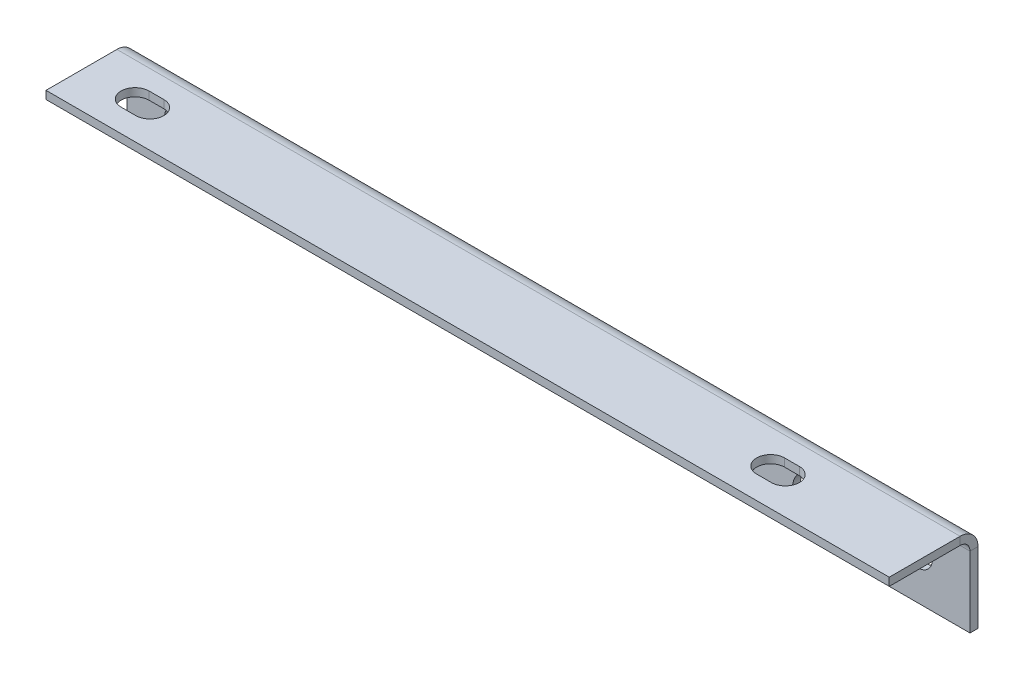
ISO-10303-21;
HEADER;
FILE_DESCRIPTION(('STEP AP214'),'2;1');
FILE_NAME('part.step','',(''),(''),'','','');
FILE_SCHEMA(('AUTOMOTIVE_DESIGN { 1 0 10303 214 1 1 1 1 }'));
ENDSEC;
DATA;
#1=APPLICATION_CONTEXT('core data for automotive mechanical design processes');
#2=APPLICATION_PROTOCOL_DEFINITION('international standard','automotive_design',2000,#1);
#3=PRODUCT_CONTEXT('',#1,'mechanical');
#4=PRODUCT('Part','Part','',(#3));
#5=PRODUCT_RELATED_PRODUCT_CATEGORY('part','',(#4));
#6=PRODUCT_DEFINITION_FORMATION('','',#4);
#7=PRODUCT_DEFINITION_CONTEXT('part definition',#1,'design');
#8=PRODUCT_DEFINITION('design','',#6,#7);
#9=PRODUCT_DEFINITION_SHAPE('','',#8);
#10=(LENGTH_UNIT() NAMED_UNIT(*) SI_UNIT(.MILLI.,.METRE.));
#11=(NAMED_UNIT(*) PLANE_ANGLE_UNIT() SI_UNIT($,.RADIAN.));
#12=(NAMED_UNIT(*) SI_UNIT($,.STERADIAN.) SOLID_ANGLE_UNIT());
#13=UNCERTAINTY_MEASURE_WITH_UNIT(LENGTH_MEASURE(1.E-05),#10,'distance_accuracy_value','');
#14=(GEOMETRIC_REPRESENTATION_CONTEXT(3) GLOBAL_UNCERTAINTY_ASSIGNED_CONTEXT((#13)) GLOBAL_UNIT_ASSIGNED_CONTEXT((#10,
#11,#12)) REPRESENTATION_CONTEXT('',''));
#15=CARTESIAN_POINT('',(0.,0.,0.));
#16=DIRECTION('',(0.,0.,1.));
#17=DIRECTION('',(1.,0.,0.));
#18=AXIS2_PLACEMENT_3D('',#15,#16,#17);
#19=CARTESIAN_POINT('',(180.975,-3.429,0.));
#20=DIRECTION('',(1.,0.,0.));
#21=DIRECTION('',(0.,0.,-1.));
#22=AXIS2_PLACEMENT_3D('',#19,#20,#21);
#23=PLANE('',#22);
#24=DIRECTION('',(0.,0.,-1.));
#25=VECTOR('',#24,1.);
#26=CARTESIAN_POINT('',(180.975,-3.429,0.));
#27=LINE('',#26,#25);
#28=CARTESIAN_POINT('',(180.975,-3.429,38.0999999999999));
#29=VERTEX_POINT('',#28);
#30=CARTESIAN_POINT('',(180.975,-3.42900000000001,7.67079999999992));
#31=VERTEX_POINT('',#30);
#32=EDGE_CURVE('E215',#29,#31,#27,.T.);
#33=ORIENTED_EDGE('',*,*,#32,.T.);
#34=DIRECTION('',(0.,1.,0.));
#35=VECTOR('',#34,1.);
#36=CARTESIAN_POINT('',(180.975,-3.42900000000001,7.67079999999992));
#37=LINE('',#36,#35);
#38=CARTESIAN_POINT('',(180.975,0.,7.67079999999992));
#39=VERTEX_POINT('',#38);
#40=EDGE_CURVE('E186',#31,#39,#37,.T.);
#41=ORIENTED_EDGE('',*,*,#40,.T.);
#42=DIRECTION('',(0.,0.,-1.));
#43=VECTOR('',#42,1.);
#44=CARTESIAN_POINT('',(180.975,0.,0.));
#45=LINE('',#44,#43);
#46=CARTESIAN_POINT('',(180.975,0.,38.0999999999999));
#47=VERTEX_POINT('',#46);
#48=EDGE_CURVE('E205',#47,#39,#45,.T.);
#49=ORIENTED_EDGE('',*,*,#48,.F.);
#50=DIRECTION('',(0.,1.,0.));
#51=VECTOR('',#50,1.);
#52=CARTESIAN_POINT('',(180.975,-3.429,38.0999999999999));
#53=LINE('',#52,#51);
#54=EDGE_CURVE('E220',#29,#47,#53,.T.);
#55=ORIENTED_EDGE('',*,*,#54,.F.);
#56=EDGE_LOOP('',(#33,#41,#49,#55));
#57=FACE_BOUND('',#56,.T.);
#58=ADVANCED_FACE('F59',(#57),#23,.T.);
#59=CARTESIAN_POINT('',(0.,-3.429,0.));
#60=DIRECTION('',(0.,1.,0.));
#61=DIRECTION('',(0.,0.,1.));
#62=AXIS2_PLACEMENT_3D('',#59,#60,#61);
#63=PLANE('',#62);
#64=DIRECTION('',(-1.,0.,0.));
#65=VECTOR('',#64,1.);
#66=CARTESIAN_POINT('',(0.,-3.429,16.225));
#67=LINE('',#66,#65);
#68=CARTESIAN_POINT('',(-152.273,-3.429,16.225));
#69=VERTEX_POINT('',#68);
#70=CARTESIAN_POINT('',(-158.623,-3.429,16.225));
#71=VERTEX_POINT('',#70);
#72=EDGE_CURVE('E121',#69,#71,#67,.T.);
#73=ORIENTED_EDGE('',*,*,#72,.T.);
#74=CARTESIAN_POINT('',(-158.623,-3.429,22.225));
#75=DIRECTION('',(0.,1.,0.));
#76=DIRECTION('',(0.,0.,1.));
#77=AXIS2_PLACEMENT_3D('',#74,#75,#76);
#78=CIRCLE('',#77,6.00000000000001);
#79=CARTESIAN_POINT('',(-158.623,-3.429,28.225));
#80=VERTEX_POINT('',#79);
#81=EDGE_CURVE('E294',#71,#80,#78,.T.);
#82=ORIENTED_EDGE('',*,*,#81,.T.);
#83=DIRECTION('',(1.,0.,0.));
#84=VECTOR('',#83,1.);
#85=CARTESIAN_POINT('',(0.,-3.429,28.225));
#86=LINE('',#85,#84);
#87=CARTESIAN_POINT('',(-152.273,-3.429,28.225));
#88=VERTEX_POINT('',#87);
#89=EDGE_CURVE('E78',#80,#88,#86,.T.);
#90=ORIENTED_EDGE('',*,*,#89,.T.);
#91=CARTESIAN_POINT('',(-152.273,-3.429,22.225));
#92=DIRECTION('',(0.,1.,0.));
#93=DIRECTION('',(0.,0.,1.));
#94=AXIS2_PLACEMENT_3D('',#91,#92,#93);
#95=CIRCLE('',#94,6.00000000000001);
#96=EDGE_CURVE('E292',#88,#69,#95,.T.);
#97=ORIENTED_EDGE('',*,*,#96,.T.);
#98=EDGE_LOOP('',(#73,#82,#90,#97));
#99=FACE_BOUND('',#98,.T.);
#100=DIRECTION('',(-1.,0.,0.));
#101=VECTOR('',#100,1.);
#102=CARTESIAN_POINT('',(0.,-3.429,16.225));
#103=LINE('',#102,#101);
#104=CARTESIAN_POINT('',(120.523,-3.429,16.225));
#105=VERTEX_POINT('',#104);
#106=CARTESIAN_POINT('',(114.173,-3.429,16.225));
#107=VERTEX_POINT('',#106);
#108=EDGE_CURVE('E240',#105,#107,#103,.T.);
#109=ORIENTED_EDGE('',*,*,#108,.T.);
#110=CARTESIAN_POINT('',(114.173,-3.429,22.225));
#111=DIRECTION('',(0.,1.,0.));
#112=DIRECTION('',(0.,0.,1.));
#113=AXIS2_PLACEMENT_3D('',#110,#111,#112);
#114=CIRCLE('',#113,6.);
#115=CARTESIAN_POINT('',(114.173,-3.429,28.225));
#116=VERTEX_POINT('',#115);
#117=EDGE_CURVE('E289',#107,#116,#114,.T.);
#118=ORIENTED_EDGE('',*,*,#117,.T.);
#119=DIRECTION('',(1.,0.,0.));
#120=VECTOR('',#119,1.);
#121=CARTESIAN_POINT('',(0.,-3.429,28.225));
#122=LINE('',#121,#120);
#123=CARTESIAN_POINT('',(120.523,-3.429,28.225));
#124=VERTEX_POINT('',#123);
#125=EDGE_CURVE('E237',#116,#124,#122,.T.);
#126=ORIENTED_EDGE('',*,*,#125,.T.);
#127=CARTESIAN_POINT('',(120.523,-3.429,22.225));
#128=DIRECTION('',(0.,1.,0.));
#129=DIRECTION('',(0.,0.,1.));
#130=AXIS2_PLACEMENT_3D('',#127,#128,#129);
#131=CIRCLE('',#130,6.);
#132=EDGE_CURVE('E286',#124,#105,#131,.T.);
#133=ORIENTED_EDGE('',*,*,#132,.T.);
#134=EDGE_LOOP('',(#109,#118,#126,#133));
#135=FACE_BOUND('',#134,.T.);
#136=DIRECTION('',(1.,0.,0.));
#137=VECTOR('',#136,1.);
#138=CARTESIAN_POINT('',(180.975,-3.42900000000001,7.67079999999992));
#139=LINE('',#138,#137);
#140=CARTESIAN_POINT('',(-180.975,-3.42900000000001,7.67079999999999));
#141=VERTEX_POINT('',#140);
#142=EDGE_CURVE('E334',#31,#141,#139,.F.);
#143=ORIENTED_EDGE('',*,*,#142,.F.);
#144=ORIENTED_EDGE('',*,*,#32,.F.);
#145=DIRECTION('',(1.,0.,0.));
#146=VECTOR('',#145,1.);
#147=CARTESIAN_POINT('',(-180.975,-3.429,38.1));
#148=LINE('',#147,#146);
#149=CARTESIAN_POINT('',(-180.975,-3.429,38.1));
#150=VERTEX_POINT('',#149);
#151=EDGE_CURVE('E340',#150,#29,#148,.T.);
#152=ORIENTED_EDGE('',*,*,#151,.F.);
#153=DIRECTION('',(0.,0.,1.));
#154=VECTOR('',#153,1.);
#155=CARTESIAN_POINT('',(-180.975,-3.429,0.));
#156=LINE('',#155,#154);
#157=EDGE_CURVE('E219',#141,#150,#156,.T.);
#158=ORIENTED_EDGE('',*,*,#157,.F.);
#159=EDGE_LOOP('',(#143,#144,#152,#158));
#160=FACE_BOUND('',#159,.T.);
#161=ADVANCED_FACE('F349',(#99,#135,#160),#63,.F.);
#162=CARTESIAN_POINT('',(0.,0.,0.));
#163=DIRECTION('',(0.,1.,0.));
#164=DIRECTION('',(0.,0.,1.));
#165=AXIS2_PLACEMENT_3D('',#162,#163,#164);
#166=PLANE('',#165);
#167=CARTESIAN_POINT('',(-158.623,0.,22.225));
#168=DIRECTION('',(0.,1.,0.));
#169=DIRECTION('',(0.,0.,1.));
#170=AXIS2_PLACEMENT_3D('',#167,#168,#169);
#171=CIRCLE('',#170,6.00000000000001);
#172=CARTESIAN_POINT('',(-158.623,0.,16.225));
#173=VERTEX_POINT('',#172);
#174=CARTESIAN_POINT('',(-158.623,0.,28.225));
#175=VERTEX_POINT('',#174);
#176=EDGE_CURVE('E13',#173,#175,#171,.T.);
#177=ORIENTED_EDGE('',*,*,#176,.F.);
#178=DIRECTION('',(-1.,0.,0.));
#179=VECTOR('',#178,1.);
#180=CARTESIAN_POINT('',(0.,0.,16.225));
#181=LINE('',#180,#179);
#182=CARTESIAN_POINT('',(-152.273,0.,16.225));
#183=VERTEX_POINT('',#182);
#184=EDGE_CURVE('E114',#183,#173,#181,.T.);
#185=ORIENTED_EDGE('',*,*,#184,.F.);
#186=CARTESIAN_POINT('',(-152.273,0.,22.225));
#187=DIRECTION('',(0.,1.,0.));
#188=DIRECTION('',(0.,0.,1.));
#189=AXIS2_PLACEMENT_3D('',#186,#187,#188);
#190=CIRCLE('',#189,6.00000000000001);
#191=CARTESIAN_POINT('',(-152.273,0.,28.225));
#192=VERTEX_POINT('',#191);
#193=EDGE_CURVE('E69',#192,#183,#190,.T.);
#194=ORIENTED_EDGE('',*,*,#193,.F.);
#195=DIRECTION('',(1.,0.,0.));
#196=VECTOR('',#195,1.);
#197=CARTESIAN_POINT('',(0.,0.,28.225));
#198=LINE('',#197,#196);
#199=EDGE_CURVE('E241',#175,#192,#198,.T.);
#200=ORIENTED_EDGE('',*,*,#199,.F.);
#201=EDGE_LOOP('',(#177,#185,#194,#200));
#202=FACE_BOUND('',#201,.T.);
#203=CARTESIAN_POINT('',(114.173,0.,22.225));
#204=DIRECTION('',(0.,1.,0.));
#205=DIRECTION('',(0.,0.,1.));
#206=AXIS2_PLACEMENT_3D('',#203,#204,#205);
#207=CIRCLE('',#206,6.);
#208=CARTESIAN_POINT('',(114.173,0.,16.225));
#209=VERTEX_POINT('',#208);
#210=CARTESIAN_POINT('',(114.173,0.,28.225));
#211=VERTEX_POINT('',#210);
#212=EDGE_CURVE('E246',#209,#211,#207,.T.);
#213=ORIENTED_EDGE('',*,*,#212,.F.);
#214=DIRECTION('',(-1.,0.,0.));
#215=VECTOR('',#214,1.);
#216=CARTESIAN_POINT('',(0.,0.,16.225));
#217=LINE('',#216,#215);
#218=CARTESIAN_POINT('',(120.523,0.,16.225));
#219=VERTEX_POINT('',#218);
#220=EDGE_CURVE('E238',#219,#209,#217,.T.);
#221=ORIENTED_EDGE('',*,*,#220,.F.);
#222=CARTESIAN_POINT('',(120.523,0.,22.225));
#223=DIRECTION('',(0.,1.,0.));
#224=DIRECTION('',(0.,0.,1.));
#225=AXIS2_PLACEMENT_3D('',#222,#223,#224);
#226=CIRCLE('',#225,6.);
#227=CARTESIAN_POINT('',(120.523,0.,28.225));
#228=VERTEX_POINT('',#227);
#229=EDGE_CURVE('E222',#228,#219,#226,.T.);
#230=ORIENTED_EDGE('',*,*,#229,.F.);
#231=DIRECTION('',(1.,0.,0.));
#232=VECTOR('',#231,1.);
#233=CARTESIAN_POINT('',(0.,0.,28.225));
#234=LINE('',#233,#232);
#235=EDGE_CURVE('E235',#211,#228,#234,.T.);
#236=ORIENTED_EDGE('',*,*,#235,.F.);
#237=EDGE_LOOP('',(#213,#221,#230,#236));
#238=FACE_BOUND('',#237,.T.);
#239=ORIENTED_EDGE('',*,*,#48,.T.);
#240=DIRECTION('',(1.,0.,0.));
#241=VECTOR('',#240,1.);
#242=CARTESIAN_POINT('',(180.975,0.,7.67079999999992));
#243=LINE('',#242,#241);
#244=CARTESIAN_POINT('',(-180.975,0.,7.67079999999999));
#245=VERTEX_POINT('',#244);
#246=EDGE_CURVE('E180',#39,#245,#243,.F.);
#247=ORIENTED_EDGE('',*,*,#246,.T.);
#248=DIRECTION('',(0.,0.,1.));
#249=VECTOR('',#248,1.);
#250=CARTESIAN_POINT('',(-180.975,0.,0.));
#251=LINE('',#250,#249);
#252=CARTESIAN_POINT('',(-180.975,0.,38.1));
#253=VERTEX_POINT('',#252);
#254=EDGE_CURVE('E197',#245,#253,#251,.T.);
#255=ORIENTED_EDGE('',*,*,#254,.T.);
#256=DIRECTION('',(1.,0.,0.));
#257=VECTOR('',#256,1.);
#258=CARTESIAN_POINT('',(-180.975,0.,38.1));
#259=LINE('',#258,#257);
#260=EDGE_CURVE('E211',#253,#47,#259,.T.);
#261=ORIENTED_EDGE('',*,*,#260,.T.);
#262=EDGE_LOOP('',(#239,#247,#255,#261));
#263=FACE_BOUND('',#262,.T.);
#264=ADVANCED_FACE('F201',(#202,#238,#263),#166,.T.);
#265=CARTESIAN_POINT('',(-180.975,-3.429,0.));
#266=DIRECTION('',(-1.,0.,0.));
#267=DIRECTION('',(0.,0.,1.));
#268=AXIS2_PLACEMENT_3D('',#265,#266,#267);
#269=PLANE('',#268);
#270=DIRECTION('',(0.,1.,0.));
#271=VECTOR('',#270,1.);
#272=CARTESIAN_POINT('',(-180.975,-3.42900000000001,7.67079999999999));
#273=LINE('',#272,#271);
#274=EDGE_CURVE('E190',#141,#245,#273,.T.);
#275=ORIENTED_EDGE('',*,*,#274,.F.);
#276=ORIENTED_EDGE('',*,*,#157,.T.);
#277=DIRECTION('',(0.,1.,0.));
#278=VECTOR('',#277,1.);
#279=CARTESIAN_POINT('',(-180.975,-3.429,38.1));
#280=LINE('',#279,#278);
#281=EDGE_CURVE('E209',#150,#253,#280,.T.);
#282=ORIENTED_EDGE('',*,*,#281,.T.);
#283=ORIENTED_EDGE('',*,*,#254,.F.);
#284=EDGE_LOOP('',(#275,#276,#282,#283));
#285=FACE_BOUND('',#284,.T.);
#286=ADVANCED_FACE('F61',(#285),#269,.T.);
#287=CARTESIAN_POINT('',(-180.975,-3.429,38.1));
#288=DIRECTION('',(0.,0.,1.));
#289=DIRECTION('',(1.,0.,0.));
#290=AXIS2_PLACEMENT_3D('',#287,#288,#289);
#291=PLANE('',#290);
#292=ORIENTED_EDGE('',*,*,#260,.F.);
#293=ORIENTED_EDGE('',*,*,#281,.F.);
#294=ORIENTED_EDGE('',*,*,#151,.T.);
#295=ORIENTED_EDGE('',*,*,#54,.T.);
#296=EDGE_LOOP('',(#292,#293,#294,#295));
#297=FACE_BOUND('',#296,.T.);
#298=ADVANCED_FACE('F393',(#297),#291,.T.);
#299=CARTESIAN_POINT('',(-180.975,-7.67080000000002,7.67079999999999));
#300=DIRECTION('',(-1.,0.,0.));
#301=DIRECTION('',(0.,0.,1.));
#302=AXIS2_PLACEMENT_3D('',#299,#300,#301);
#303=PLANE('',#302);
#304=DIRECTION('',(0.,0.,1.));
#305=VECTOR('',#304,1.);
#306=CARTESIAN_POINT('',(-180.975,-7.67079999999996,0.));
#307=LINE('',#306,#305);
#308=CARTESIAN_POINT('',(-180.975,-7.67080000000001,3.42899999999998));
#309=VERTEX_POINT('',#308);
#310=CARTESIAN_POINT('',(-180.975,-7.67079999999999,0.));
#311=VERTEX_POINT('',#310);
#312=EDGE_CURVE('E234',#309,#311,#307,.F.);
#313=ORIENTED_EDGE('',*,*,#312,.F.);
#314=CARTESIAN_POINT('',(-180.975,-7.67080000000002,7.67079999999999));
#315=DIRECTION('',(1.,0.,0.));
#316=DIRECTION('',(0.,0.,-1.));
#317=AXIS2_PLACEMENT_3D('',#314,#315,#316);
#318=CIRCLE('',#317,4.24180000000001);
#319=EDGE_CURVE('E193',#141,#309,#318,.F.);
#320=ORIENTED_EDGE('',*,*,#319,.F.);
#321=ORIENTED_EDGE('',*,*,#274,.T.);
#322=CARTESIAN_POINT('',(-180.975,-7.67080000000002,7.67079999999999));
#323=DIRECTION('',(1.,0.,0.));
#324=DIRECTION('',(0.,0.,-1.));
#325=AXIS2_PLACEMENT_3D('',#322,#323,#324);
#326=CIRCLE('',#325,7.67080000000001);
#327=EDGE_CURVE('E176',#245,#311,#326,.F.);
#328=ORIENTED_EDGE('',*,*,#327,.T.);
#329=EDGE_LOOP('',(#313,#320,#321,#328));
#330=FACE_BOUND('',#329,.T.);
#331=ADVANCED_FACE('F191',(#330),#303,.T.);
#332=CARTESIAN_POINT('',(180.975,-7.67080000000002,7.67079999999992));
#333=DIRECTION('',(-1.,0.,0.));
#334=DIRECTION('',(0.,0.,1.));
#335=AXIS2_PLACEMENT_3D('',#332,#333,#334);
#336=PLANE('',#335);
#337=CARTESIAN_POINT('',(180.975,-7.67080000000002,7.67079999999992));
#338=DIRECTION('',(1.,0.,0.));
#339=DIRECTION('',(0.,0.,-1.));
#340=AXIS2_PLACEMENT_3D('',#337,#338,#339);
#341=CIRCLE('',#340,4.24180000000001);
#342=CARTESIAN_POINT('',(180.975,-7.67080000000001,3.42899999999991));
#343=VERTEX_POINT('',#342);
#344=EDGE_CURVE('E307',#343,#31,#341,.T.);
#345=ORIENTED_EDGE('',*,*,#344,.F.);
#346=DIRECTION('',(0.,0.,1.));
#347=VECTOR('',#346,1.);
#348=CARTESIAN_POINT('',(180.975,-7.6708,3.42899999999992));
#349=LINE('',#348,#347);
#350=CARTESIAN_POINT('',(180.975,-7.67079999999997,0.));
#351=VERTEX_POINT('',#350);
#352=EDGE_CURVE('E326',#343,#351,#349,.F.);
#353=ORIENTED_EDGE('',*,*,#352,.T.);
#354=CARTESIAN_POINT('',(180.975,-7.67080000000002,7.67079999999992));
#355=DIRECTION('',(1.,0.,0.));
#356=DIRECTION('',(0.,0.,-1.));
#357=AXIS2_PLACEMENT_3D('',#354,#355,#356);
#358=CIRCLE('',#357,7.67080000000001);
#359=EDGE_CURVE('E206',#351,#39,#358,.T.);
#360=ORIENTED_EDGE('',*,*,#359,.T.);
#361=ORIENTED_EDGE('',*,*,#40,.F.);
#362=EDGE_LOOP('',(#345,#353,#360,#361));
#363=FACE_BOUND('',#362,.T.);
#364=ADVANCED_FACE('F356',(#363),#336,.F.);
#365=CARTESIAN_POINT('',(180.975,-7.67080000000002,7.67079999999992));
#366=DIRECTION('',(1.,0.,0.));
#367=DIRECTION('',(0.,0.,-1.));
#368=AXIS2_PLACEMENT_3D('',#365,#366,#367);
#369=CYLINDRICAL_SURFACE('',#368,7.67080000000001);
#370=ORIENTED_EDGE('',*,*,#246,.F.);
#371=ORIENTED_EDGE('',*,*,#359,.F.);
#372=DIRECTION('',(1.,0.,0.));
#373=VECTOR('',#372,1.);
#374=CARTESIAN_POINT('',(-180.975,-7.67079999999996,0.));
#375=LINE('',#374,#373);
#376=EDGE_CURVE('E183',#351,#311,#375,.F.);
#377=ORIENTED_EDGE('',*,*,#376,.T.);
#378=ORIENTED_EDGE('',*,*,#327,.F.);
#379=EDGE_LOOP('',(#370,#371,#377,#378));
#380=FACE_BOUND('',#379,.T.);
#381=ADVANCED_FACE('F178',(#380),#369,.T.);
#382=CARTESIAN_POINT('',(180.975,-7.67080000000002,7.67079999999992));
#383=DIRECTION('',(1.,0.,0.));
#384=DIRECTION('',(0.,0.,-1.));
#385=AXIS2_PLACEMENT_3D('',#382,#383,#384);
#386=CYLINDRICAL_SURFACE('',#385,4.24180000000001);
#387=ORIENTED_EDGE('',*,*,#142,.T.);
#388=ORIENTED_EDGE('',*,*,#319,.T.);
#389=DIRECTION('',(1.,0.,0.));
#390=VECTOR('',#389,1.);
#391=CARTESIAN_POINT('',(-180.975,-7.67079999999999,3.42899999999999));
#392=LINE('',#391,#390);
#393=EDGE_CURVE('E329',#309,#343,#392,.T.);
#394=ORIENTED_EDGE('',*,*,#393,.T.);
#395=ORIENTED_EDGE('',*,*,#344,.T.);
#396=EDGE_LOOP('',(#387,#388,#394,#395));
#397=FACE_BOUND('',#396,.T.);
#398=ADVANCED_FACE('F351',(#397),#386,.F.);
#399=CARTESIAN_POINT('',(180.975,-38.1,-1.87350135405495E-13));
#400=DIRECTION('',(-1.,0.,0.));
#401=DIRECTION('',(0.,0.,1.));
#402=AXIS2_PLACEMENT_3D('',#399,#400,#401);
#403=PLANE('',#402);
#404=ORIENTED_EDGE('',*,*,#352,.F.);
#405=DIRECTION('',(0.,1.,0.));
#406=VECTOR('',#405,1.);
#407=CARTESIAN_POINT('',(180.975,-38.1,3.42899999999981));
#408=LINE('',#407,#406);
#409=CARTESIAN_POINT('',(180.975,-38.1,3.42899999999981));
#410=VERTEX_POINT('',#409);
#411=EDGE_CURVE('E323',#343,#410,#408,.F.);
#412=ORIENTED_EDGE('',*,*,#411,.T.);
#413=DIRECTION('',(0.,0.,1.));
#414=VECTOR('',#413,1.);
#415=CARTESIAN_POINT('',(180.975,-38.1,-1.8748609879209E-13));
#416=LINE('',#415,#414);
#417=CARTESIAN_POINT('',(180.975,-38.1,-1.87520369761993E-13));
#418=VERTEX_POINT('',#417);
#419=EDGE_CURVE('E304',#418,#410,#416,.T.);
#420=ORIENTED_EDGE('',*,*,#419,.F.);
#421=DIRECTION('',(0.,-1.,0.));
#422=VECTOR('',#421,1.);
#423=CARTESIAN_POINT('',(180.975,0.,0.));
#424=LINE('',#423,#422);
#425=EDGE_CURVE('E316',#351,#418,#424,.T.);
#426=ORIENTED_EDGE('',*,*,#425,.F.);
#427=EDGE_LOOP('',(#404,#412,#420,#426));
#428=FACE_BOUND('',#427,.T.);
#429=ADVANCED_FACE('F360',(#428),#403,.F.);
#430=CARTESIAN_POINT('',(-180.975,-3.42899999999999,0.));
#431=DIRECTION('',(1.,0.,0.));
#432=DIRECTION('',(0.,0.,-1.));
#433=AXIS2_PLACEMENT_3D('',#430,#431,#432);
#434=PLANE('',#433);
#435=ORIENTED_EDGE('',*,*,#312,.T.);
#436=DIRECTION('',(0.,1.,0.));
#437=VECTOR('',#436,1.);
#438=CARTESIAN_POINT('',(-180.975,0.,0.));
#439=LINE('',#438,#437);
#440=CARTESIAN_POINT('',(-180.975,-38.1,-1.21031233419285E-13));
#441=VERTEX_POINT('',#440);
#442=EDGE_CURVE('E311',#441,#311,#439,.T.);
#443=ORIENTED_EDGE('',*,*,#442,.F.);
#444=DIRECTION('',(0.,0.,1.));
#445=VECTOR('',#444,1.);
#446=CARTESIAN_POINT('',(-180.975,-38.1,-1.2105314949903E-13));
#447=LINE('',#446,#445);
#448=CARTESIAN_POINT('',(-180.975,-38.1,3.42899999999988));
#449=VERTEX_POINT('',#448);
#450=EDGE_CURVE('E308',#441,#449,#447,.T.);
#451=ORIENTED_EDGE('',*,*,#450,.T.);
#452=DIRECTION('',(0.,-1.,0.));
#453=VECTOR('',#452,1.);
#454=CARTESIAN_POINT('',(-180.975,-3.429,3.429));
#455=LINE('',#454,#453);
#456=EDGE_CURVE('E318',#449,#309,#455,.F.);
#457=ORIENTED_EDGE('',*,*,#456,.T.);
#458=EDGE_LOOP('',(#435,#443,#451,#457));
#459=FACE_BOUND('',#458,.T.);
#460=ADVANCED_FACE('F374',(#459),#434,.F.);
#461=CARTESIAN_POINT('',(0.,0.,0.));
#462=DIRECTION('',(0.,0.,1.));
#463=DIRECTION('',(0.,-1.,0.));
#464=AXIS2_PLACEMENT_3D('',#461,#462,#463);
#465=PLANE('',#464);
#466=CARTESIAN_POINT('',(-114.3,-22.225,-1.87350135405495E-13));
#467=DIRECTION('',(0.,0.,1.));
#468=DIRECTION('',(1.,0.,0.));
#469=AXIS2_PLACEMENT_3D('',#466,#467,#468);
#470=CIRCLE('',#469,9.52500000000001);
#471=CARTESIAN_POINT('',(-104.775,-22.225,-1.87350135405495E-13));
#472=VERTEX_POINT('',#471);
#473=EDGE_CURVE('E253',#472,#472,#470,.T.);
#474=ORIENTED_EDGE('',*,*,#473,.T.);
#475=EDGE_LOOP('',(#474));
#476=FACE_BOUND('',#475,.T.);
#477=CARTESIAN_POINT('',(-76.2,-22.225,-1.87350135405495E-13));
#478=DIRECTION('',(0.,0.,1.));
#479=DIRECTION('',(1.,0.,0.));
#480=AXIS2_PLACEMENT_3D('',#477,#478,#479);
#481=CIRCLE('',#480,9.52500000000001);
#482=CARTESIAN_POINT('',(-66.675,-22.225,-1.87350135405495E-13));
#483=VERTEX_POINT('',#482);
#484=EDGE_CURVE('E442',#483,#483,#481,.T.);
#485=ORIENTED_EDGE('',*,*,#484,.T.);
#486=EDGE_LOOP('',(#485));
#487=FACE_BOUND('',#486,.T.);
#488=CARTESIAN_POINT('',(-38.1,-22.225,-1.87350135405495E-13));
#489=DIRECTION('',(0.,0.,1.));
#490=DIRECTION('',(1.,0.,0.));
#491=AXIS2_PLACEMENT_3D('',#488,#489,#490);
#492=CIRCLE('',#491,9.525);
#493=CARTESIAN_POINT('',(-28.575,-22.225,-1.87350135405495E-13));
#494=VERTEX_POINT('',#493);
#495=EDGE_CURVE('E439',#494,#494,#492,.T.);
#496=ORIENTED_EDGE('',*,*,#495,.T.);
#497=EDGE_LOOP('',(#496));
#498=FACE_BOUND('',#497,.T.);
#499=CARTESIAN_POINT('',(38.1,-22.225,-1.87350135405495E-13));
#500=DIRECTION('',(0.,0.,1.));
#501=DIRECTION('',(1.,0.,0.));
#502=AXIS2_PLACEMENT_3D('',#499,#500,#501);
#503=CIRCLE('',#502,9.525);
#504=CARTESIAN_POINT('',(47.625,-22.225,-1.87350135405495E-13));
#505=VERTEX_POINT('',#504);
#506=EDGE_CURVE('E436',#505,#505,#503,.T.);
#507=ORIENTED_EDGE('',*,*,#506,.T.);
#508=EDGE_LOOP('',(#507));
#509=FACE_BOUND('',#508,.T.);
#510=CARTESIAN_POINT('',(76.2,-22.225,-1.87350135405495E-13));
#511=DIRECTION('',(0.,0.,1.));
#512=DIRECTION('',(1.,0.,0.));
#513=AXIS2_PLACEMENT_3D('',#510,#511,#512);
#514=CIRCLE('',#513,9.52500000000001);
#515=CARTESIAN_POINT('',(85.725,-22.225,-1.87350135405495E-13));
#516=VERTEX_POINT('',#515);
#517=EDGE_CURVE('E433',#516,#516,#514,.T.);
#518=ORIENTED_EDGE('',*,*,#517,.T.);
#519=EDGE_LOOP('',(#518));
#520=FACE_BOUND('',#519,.T.);
#521=CARTESIAN_POINT('',(114.3,-22.225,-1.87350135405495E-13));
#522=DIRECTION('',(0.,0.,1.));
#523=DIRECTION('',(1.,0.,0.));
#524=AXIS2_PLACEMENT_3D('',#521,#522,#523);
#525=CIRCLE('',#524,9.52500000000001);
#526=CARTESIAN_POINT('',(123.825,-22.225,-1.87350135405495E-13));
#527=VERTEX_POINT('',#526);
#528=EDGE_CURVE('E430',#527,#527,#525,.T.);
#529=ORIENTED_EDGE('',*,*,#528,.T.);
#530=EDGE_LOOP('',(#529));
#531=FACE_BOUND('',#530,.T.);
#532=CARTESIAN_POINT('',(-158.75,-19.05,-1.87350135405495E-13));
#533=DIRECTION('',(0.,0.,1.));
#534=DIRECTION('',(1.,0.,0.));
#535=AXIS2_PLACEMENT_3D('',#532,#533,#534);
#536=CIRCLE('',#535,6.00000000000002);
#537=CARTESIAN_POINT('',(-152.75,-19.05,-1.87350135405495E-13));
#538=VERTEX_POINT('',#537);
#539=EDGE_CURVE('E296',#538,#538,#536,.T.);
#540=ORIENTED_EDGE('',*,*,#539,.T.);
#541=EDGE_LOOP('',(#540));
#542=FACE_BOUND('',#541,.T.);
#543=CARTESIAN_POINT('',(158.75,-19.05,-1.87350135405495E-13));
#544=DIRECTION('',(0.,0.,1.));
#545=DIRECTION('',(1.,0.,0.));
#546=AXIS2_PLACEMENT_3D('',#543,#544,#545);
#547=CIRCLE('',#546,6.00000000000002);
#548=CARTESIAN_POINT('',(164.75,-19.05,-1.87350135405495E-13));
#549=VERTEX_POINT('',#548);
#550=EDGE_CURVE('E297',#549,#549,#547,.T.);
#551=ORIENTED_EDGE('',*,*,#550,.T.);
#552=EDGE_LOOP('',(#551));
#553=FACE_BOUND('',#552,.T.);
#554=CARTESIAN_POINT('',(0.,-19.05,-1.87350135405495E-13));
#555=DIRECTION('',(0.,0.,1.));
#556=DIRECTION('',(1.,0.,0.));
#557=AXIS2_PLACEMENT_3D('',#554,#555,#556);
#558=CIRCLE('',#557,6.);
#559=CARTESIAN_POINT('',(6.,-19.05,-1.87350135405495E-13));
#560=VERTEX_POINT('',#559);
#561=EDGE_CURVE('E228',#560,#560,#558,.T.);
#562=ORIENTED_EDGE('',*,*,#561,.T.);
#563=EDGE_LOOP('',(#562));
#564=FACE_BOUND('',#563,.T.);
#565=ORIENTED_EDGE('',*,*,#376,.F.);
#566=ORIENTED_EDGE('',*,*,#425,.T.);
#567=DIRECTION('',(-1.,0.,0.));
#568=VECTOR('',#567,1.);
#569=CARTESIAN_POINT('',(0.,-38.1,-1.54275801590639E-13));
#570=LINE('',#569,#568);
#571=EDGE_CURVE('E314',#418,#441,#570,.T.);
#572=ORIENTED_EDGE('',*,*,#571,.T.);
#573=ORIENTED_EDGE('',*,*,#442,.T.);
#574=EDGE_LOOP('',(#565,#566,#572,#573));
#575=FACE_BOUND('',#574,.T.);
#576=ADVANCED_FACE('F372',(#476,#487,#498,#509,#520,#531,#542,#553,#564,#575),#465,.F.);
#577=CARTESIAN_POINT('',(0.,0.,3.42899999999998));
#578=DIRECTION('',(0.,0.,1.));
#579=DIRECTION('',(0.,-1.,0.));
#580=AXIS2_PLACEMENT_3D('',#577,#578,#579);
#581=PLANE('',#580);
#582=CARTESIAN_POINT('',(-114.3,-22.225,3.42899999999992));
#583=DIRECTION('',(0.,0.,1.));
#584=DIRECTION('',(0.,-1.,0.));
#585=AXIS2_PLACEMENT_3D('',#582,#583,#584);
#586=CIRCLE('',#585,9.52500000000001);
#587=CARTESIAN_POINT('',(-114.3,-31.75,3.42899999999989));
#588=VERTEX_POINT('',#587);
#589=EDGE_CURVE('E63',#588,#588,#586,.T.);
#590=ORIENTED_EDGE('',*,*,#589,.F.);
#591=EDGE_LOOP('',(#590));
#592=FACE_BOUND('',#591,.T.);
#593=CARTESIAN_POINT('',(-76.2,-22.225,3.42899999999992));
#594=DIRECTION('',(0.,0.,1.));
#595=DIRECTION('',(0.,-1.,0.));
#596=AXIS2_PLACEMENT_3D('',#593,#594,#595);
#597=CIRCLE('',#596,9.52500000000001);
#598=CARTESIAN_POINT('',(-76.2,-31.75,3.42899999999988));
#599=VERTEX_POINT('',#598);
#600=EDGE_CURVE('E261',#599,#599,#597,.T.);
#601=ORIENTED_EDGE('',*,*,#600,.F.);
#602=EDGE_LOOP('',(#601));
#603=FACE_BOUND('',#602,.T.);
#604=CARTESIAN_POINT('',(-38.1,-22.225,3.42899999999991));
#605=DIRECTION('',(0.,0.,1.));
#606=DIRECTION('',(0.,-1.,0.));
#607=AXIS2_PLACEMENT_3D('',#604,#605,#606);
#608=CIRCLE('',#607,9.525);
#609=CARTESIAN_POINT('',(-38.1,-31.75,3.42899999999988));
#610=VERTEX_POINT('',#609);
#611=EDGE_CURVE('E259',#610,#610,#608,.T.);
#612=ORIENTED_EDGE('',*,*,#611,.F.);
#613=EDGE_LOOP('',(#612));
#614=FACE_BOUND('',#613,.T.);
#615=CARTESIAN_POINT('',(38.1,-22.225,3.42899999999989));
#616=DIRECTION('',(0.,0.,1.));
#617=DIRECTION('',(0.,-1.,0.));
#618=AXIS2_PLACEMENT_3D('',#615,#616,#617);
#619=CIRCLE('',#618,9.525);
#620=CARTESIAN_POINT('',(38.1,-31.75,3.42899999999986));
#621=VERTEX_POINT('',#620);
#622=EDGE_CURVE('E256',#621,#621,#619,.T.);
#623=ORIENTED_EDGE('',*,*,#622,.F.);
#624=EDGE_LOOP('',(#623));
#625=FACE_BOUND('',#624,.T.);
#626=CARTESIAN_POINT('',(76.2,-22.225,3.42899999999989));
#627=DIRECTION('',(0.,0.,1.));
#628=DIRECTION('',(0.,-1.,0.));
#629=AXIS2_PLACEMENT_3D('',#626,#627,#628);
#630=CIRCLE('',#629,9.52500000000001);
#631=CARTESIAN_POINT('',(76.2,-31.75,3.42899999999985));
#632=VERTEX_POINT('',#631);
#633=EDGE_CURVE('E252',#632,#632,#630,.T.);
#634=ORIENTED_EDGE('',*,*,#633,.F.);
#635=EDGE_LOOP('',(#634));
#636=FACE_BOUND('',#635,.T.);
#637=CARTESIAN_POINT('',(114.3,-22.225,3.42899999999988));
#638=DIRECTION('',(0.,0.,1.));
#639=DIRECTION('',(0.,-1.,0.));
#640=AXIS2_PLACEMENT_3D('',#637,#638,#639);
#641=CIRCLE('',#640,9.52500000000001);
#642=CARTESIAN_POINT('',(114.3,-31.75,3.42899999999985));
#643=VERTEX_POINT('',#642);
#644=EDGE_CURVE('E249',#643,#643,#641,.T.);
#645=ORIENTED_EDGE('',*,*,#644,.F.);
#646=EDGE_LOOP('',(#645));
#647=FACE_BOUND('',#646,.T.);
#648=CARTESIAN_POINT('',(-158.75,-19.05,3.42899999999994));
#649=DIRECTION('',(0.,0.,1.));
#650=DIRECTION('',(0.,-1.,0.));
#651=AXIS2_PLACEMENT_3D('',#648,#649,#650);
#652=CIRCLE('',#651,6.00000000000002);
#653=CARTESIAN_POINT('',(-158.75,-25.05,3.42899999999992));
#654=VERTEX_POINT('',#653);
#655=EDGE_CURVE('E231',#654,#654,#652,.T.);
#656=ORIENTED_EDGE('',*,*,#655,.F.);
#657=EDGE_LOOP('',(#656));
#658=FACE_BOUND('',#657,.T.);
#659=CARTESIAN_POINT('',(158.75,-19.05,3.42899999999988));
#660=DIRECTION('',(0.,0.,1.));
#661=DIRECTION('',(0.,-1.,0.));
#662=AXIS2_PLACEMENT_3D('',#659,#660,#661);
#663=CIRCLE('',#662,6.00000000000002);
#664=CARTESIAN_POINT('',(158.75,-25.05,3.42899999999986));
#665=VERTEX_POINT('',#664);
#666=EDGE_CURVE('E227',#665,#665,#663,.T.);
#667=ORIENTED_EDGE('',*,*,#666,.F.);
#668=EDGE_LOOP('',(#667));
#669=FACE_BOUND('',#668,.T.);
#670=CARTESIAN_POINT('',(0.,-19.05,3.42899999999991));
#671=DIRECTION('',(0.,0.,1.));
#672=DIRECTION('',(0.,-1.,0.));
#673=AXIS2_PLACEMENT_3D('',#670,#671,#672);
#674=CIRCLE('',#673,6.);
#675=CARTESIAN_POINT('',(0.,-25.05,3.42899999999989));
#676=VERTEX_POINT('',#675);
#677=EDGE_CURVE('E224',#676,#676,#674,.T.);
#678=ORIENTED_EDGE('',*,*,#677,.F.);
#679=EDGE_LOOP('',(#678));
#680=FACE_BOUND('',#679,.T.);
#681=ORIENTED_EDGE('',*,*,#411,.F.);
#682=ORIENTED_EDGE('',*,*,#393,.F.);
#683=ORIENTED_EDGE('',*,*,#456,.F.);
#684=DIRECTION('',(1.,0.,0.));
#685=VECTOR('',#684,1.);
#686=CARTESIAN_POINT('',(-180.975,-38.1,3.42899999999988));
#687=LINE('',#686,#685);
#688=EDGE_CURVE('E321',#410,#449,#687,.F.);
#689=ORIENTED_EDGE('',*,*,#688,.F.);
#690=EDGE_LOOP('',(#681,#682,#683,#689));
#691=FACE_BOUND('',#690,.T.);
#692=ADVANCED_FACE('F364',(#592,#603,#614,#625,#636,#647,#658,#669,#680,#691),#581,.T.);
#693=CARTESIAN_POINT('',(-180.975,-38.1,-1.20996962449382E-13));
#694=DIRECTION('',(0.,1.,0.));
#695=DIRECTION('',(0.,0.,1.));
#696=AXIS2_PLACEMENT_3D('',#693,#694,#695);
#697=PLANE('',#696);
#698=ORIENTED_EDGE('',*,*,#688,.T.);
#699=ORIENTED_EDGE('',*,*,#450,.F.);
#700=ORIENTED_EDGE('',*,*,#571,.F.);
#701=ORIENTED_EDGE('',*,*,#419,.T.);
#702=EDGE_LOOP('',(#698,#699,#700,#701));
#703=FACE_BOUND('',#702,.T.);
#704=ADVANCED_FACE('F369',(#703),#697,.F.);
#705=CARTESIAN_POINT('',(0.,-19.05,-1.87350135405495E-13));
#706=DIRECTION('',(0.,0.,1.));
#707=DIRECTION('',(1.,0.,0.));
#708=AXIS2_PLACEMENT_3D('',#705,#706,#707);
#709=CYLINDRICAL_SURFACE('',#708,6.);
#710=ORIENTED_EDGE('',*,*,#677,.T.);
#711=EDGE_LOOP('',(#710));
#712=FACE_BOUND('',#711,.T.);
#713=ORIENTED_EDGE('',*,*,#561,.F.);
#714=EDGE_LOOP('',(#713));
#715=FACE_BOUND('',#714,.T.);
#716=ADVANCED_FACE('F505',(#712,#715),#709,.F.);
#717=CARTESIAN_POINT('',(158.75,-19.05,-1.87350135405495E-13));
#718=DIRECTION('',(0.,0.,1.));
#719=DIRECTION('',(1.,0.,0.));
#720=AXIS2_PLACEMENT_3D('',#717,#718,#719);
#721=CYLINDRICAL_SURFACE('',#720,6.00000000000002);
#722=ORIENTED_EDGE('',*,*,#666,.T.);
#723=EDGE_LOOP('',(#722));
#724=FACE_BOUND('',#723,.T.);
#725=ORIENTED_EDGE('',*,*,#550,.F.);
#726=EDGE_LOOP('',(#725));
#727=FACE_BOUND('',#726,.T.);
#728=ADVANCED_FACE('F502',(#724,#727),#721,.F.);
#729=CARTESIAN_POINT('',(-158.75,-19.05,-1.87350135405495E-13));
#730=DIRECTION('',(0.,0.,1.));
#731=DIRECTION('',(1.,0.,0.));
#732=AXIS2_PLACEMENT_3D('',#729,#730,#731);
#733=CYLINDRICAL_SURFACE('',#732,6.00000000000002);
#734=ORIENTED_EDGE('',*,*,#655,.T.);
#735=EDGE_LOOP('',(#734));
#736=FACE_BOUND('',#735,.T.);
#737=ORIENTED_EDGE('',*,*,#539,.F.);
#738=EDGE_LOOP('',(#737));
#739=FACE_BOUND('',#738,.T.);
#740=ADVANCED_FACE('F501',(#736,#739),#733,.F.);
#741=CARTESIAN_POINT('',(114.173,-38.1,22.225));
#742=DIRECTION('',(0.,1.,0.));
#743=DIRECTION('',(0.,0.,1.));
#744=AXIS2_PLACEMENT_3D('',#741,#742,#743);
#745=CYLINDRICAL_SURFACE('',#744,6.);
#746=DIRECTION('',(0.,1.,0.));
#747=VECTOR('',#746,1.);
#748=CARTESIAN_POINT('',(114.173,-38.1,16.225));
#749=LINE('',#748,#747);
#750=EDGE_CURVE('E279',#107,#209,#749,.T.);
#751=ORIENTED_EDGE('',*,*,#750,.T.);
#752=ORIENTED_EDGE('',*,*,#212,.T.);
#753=DIRECTION('',(0.,1.,0.));
#754=VECTOR('',#753,1.);
#755=CARTESIAN_POINT('',(114.173,-38.1,28.225));
#756=LINE('',#755,#754);
#757=EDGE_CURVE('E266',#116,#211,#756,.T.);
#758=ORIENTED_EDGE('',*,*,#757,.F.);
#759=ORIENTED_EDGE('',*,*,#117,.F.);
#760=EDGE_LOOP('',(#751,#752,#758,#759));
#761=FACE_BOUND('',#760,.T.);
#762=ADVANCED_FACE('F414',(#761),#745,.F.);
#763=CARTESIAN_POINT('',(120.523,-38.1,22.225));
#764=DIRECTION('',(0.,1.,0.));
#765=DIRECTION('',(0.,0.,1.));
#766=AXIS2_PLACEMENT_3D('',#763,#764,#765);
#767=CYLINDRICAL_SURFACE('',#766,6.);
#768=DIRECTION('',(0.,1.,0.));
#769=VECTOR('',#768,1.);
#770=CARTESIAN_POINT('',(120.523,-38.1,28.225));
#771=LINE('',#770,#769);
#772=EDGE_CURVE('E270',#124,#228,#771,.T.);
#773=ORIENTED_EDGE('',*,*,#772,.T.);
#774=ORIENTED_EDGE('',*,*,#229,.T.);
#775=DIRECTION('',(0.,1.,0.));
#776=VECTOR('',#775,1.);
#777=CARTESIAN_POINT('',(120.523,-38.1,16.225));
#778=LINE('',#777,#776);
#779=EDGE_CURVE('E276',#105,#219,#778,.T.);
#780=ORIENTED_EDGE('',*,*,#779,.F.);
#781=ORIENTED_EDGE('',*,*,#132,.F.);
#782=EDGE_LOOP('',(#773,#774,#780,#781));
#783=FACE_BOUND('',#782,.T.);
#784=ADVANCED_FACE('F493',(#783),#767,.F.);
#785=CARTESIAN_POINT('',(114.173,-38.1,16.225));
#786=DIRECTION('',(0.,0.,-1.));
#787=DIRECTION('',(-1.,0.,0.));
#788=AXIS2_PLACEMENT_3D('',#785,#786,#787);
#789=PLANE('',#788);
#790=ORIENTED_EDGE('',*,*,#779,.T.);
#791=ORIENTED_EDGE('',*,*,#220,.T.);
#792=ORIENTED_EDGE('',*,*,#750,.F.);
#793=ORIENTED_EDGE('',*,*,#108,.F.);
#794=EDGE_LOOP('',(#790,#791,#792,#793));
#795=FACE_BOUND('',#794,.T.);
#796=ADVANCED_FACE('F490',(#795),#789,.F.);
#797=CARTESIAN_POINT('',(114.173,-38.1,28.225));
#798=DIRECTION('',(0.,0.,1.));
#799=DIRECTION('',(1.,0.,0.));
#800=AXIS2_PLACEMENT_3D('',#797,#798,#799);
#801=PLANE('',#800);
#802=ORIENTED_EDGE('',*,*,#757,.T.);
#803=ORIENTED_EDGE('',*,*,#235,.T.);
#804=ORIENTED_EDGE('',*,*,#772,.F.);
#805=ORIENTED_EDGE('',*,*,#125,.F.);
#806=EDGE_LOOP('',(#802,#803,#804,#805));
#807=FACE_BOUND('',#806,.T.);
#808=ADVANCED_FACE('F488',(#807),#801,.F.);
#809=CARTESIAN_POINT('',(-158.623,-38.1,22.225));
#810=DIRECTION('',(0.,1.,0.));
#811=DIRECTION('',(0.,0.,1.));
#812=AXIS2_PLACEMENT_3D('',#809,#810,#811);
#813=CYLINDRICAL_SURFACE('',#812,6.00000000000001);
#814=DIRECTION('',(0.,1.,0.));
#815=VECTOR('',#814,1.);
#816=CARTESIAN_POINT('',(-158.623,-38.1,16.225));
#817=LINE('',#816,#815);
#818=EDGE_CURVE('E243',#71,#173,#817,.T.);
#819=ORIENTED_EDGE('',*,*,#818,.T.);
#820=ORIENTED_EDGE('',*,*,#176,.T.);
#821=DIRECTION('',(0.,1.,0.));
#822=VECTOR('',#821,1.);
#823=CARTESIAN_POINT('',(-158.623,-38.1,28.225));
#824=LINE('',#823,#822);
#825=EDGE_CURVE('E418',#80,#175,#824,.T.);
#826=ORIENTED_EDGE('',*,*,#825,.F.);
#827=ORIENTED_EDGE('',*,*,#81,.F.);
#828=EDGE_LOOP('',(#819,#820,#826,#827));
#829=FACE_BOUND('',#828,.T.);
#830=ADVANCED_FACE('F481',(#829),#813,.F.);
#831=CARTESIAN_POINT('',(-152.273,-38.1,22.225));
#832=DIRECTION('',(0.,1.,0.));
#833=DIRECTION('',(0.,0.,1.));
#834=AXIS2_PLACEMENT_3D('',#831,#832,#833);
#835=CYLINDRICAL_SURFACE('',#834,6.00000000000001);
#836=DIRECTION('',(0.,1.,0.));
#837=VECTOR('',#836,1.);
#838=CARTESIAN_POINT('',(-152.273,-38.1,28.225));
#839=LINE('',#838,#837);
#840=EDGE_CURVE('E420',#88,#192,#839,.T.);
#841=ORIENTED_EDGE('',*,*,#840,.T.);
#842=ORIENTED_EDGE('',*,*,#193,.T.);
#843=DIRECTION('',(0.,1.,0.));
#844=VECTOR('',#843,1.);
#845=CARTESIAN_POINT('',(-152.273,-38.1,16.225));
#846=LINE('',#845,#844);
#847=EDGE_CURVE('E426',#69,#183,#846,.T.);
#848=ORIENTED_EDGE('',*,*,#847,.F.);
#849=ORIENTED_EDGE('',*,*,#96,.F.);
#850=EDGE_LOOP('',(#841,#842,#848,#849));
#851=FACE_BOUND('',#850,.T.);
#852=ADVANCED_FACE('F478',(#851),#835,.F.);
#853=CARTESIAN_POINT('',(-158.623,-38.1,16.225));
#854=DIRECTION('',(0.,0.,-1.));
#855=DIRECTION('',(-1.,0.,0.));
#856=AXIS2_PLACEMENT_3D('',#853,#854,#855);
#857=PLANE('',#856);
#858=ORIENTED_EDGE('',*,*,#847,.T.);
#859=ORIENTED_EDGE('',*,*,#184,.T.);
#860=ORIENTED_EDGE('',*,*,#818,.F.);
#861=ORIENTED_EDGE('',*,*,#72,.F.);
#862=EDGE_LOOP('',(#858,#859,#860,#861));
#863=FACE_BOUND('',#862,.T.);
#864=ADVANCED_FACE('F475',(#863),#857,.F.);
#865=CARTESIAN_POINT('',(-158.623,-38.1,28.225));
#866=DIRECTION('',(0.,0.,1.));
#867=DIRECTION('',(1.,0.,0.));
#868=AXIS2_PLACEMENT_3D('',#865,#866,#867);
#869=PLANE('',#868);
#870=ORIENTED_EDGE('',*,*,#825,.T.);
#871=ORIENTED_EDGE('',*,*,#199,.T.);
#872=ORIENTED_EDGE('',*,*,#840,.F.);
#873=ORIENTED_EDGE('',*,*,#89,.F.);
#874=EDGE_LOOP('',(#870,#871,#872,#873));
#875=FACE_BOUND('',#874,.T.);
#876=ADVANCED_FACE('F473',(#875),#869,.F.);
#877=CARTESIAN_POINT('',(114.3,-22.225,-1.87350135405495E-13));
#878=DIRECTION('',(0.,0.,1.));
#879=DIRECTION('',(1.,0.,0.));
#880=AXIS2_PLACEMENT_3D('',#877,#878,#879);
#881=CYLINDRICAL_SURFACE('',#880,9.52500000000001);
#882=ORIENTED_EDGE('',*,*,#644,.T.);
#883=EDGE_LOOP('',(#882));
#884=FACE_BOUND('',#883,.T.);
#885=ORIENTED_EDGE('',*,*,#528,.F.);
#886=EDGE_LOOP('',(#885));
#887=FACE_BOUND('',#886,.T.);
#888=ADVANCED_FACE('F469',(#884,#887),#881,.F.);
#889=CARTESIAN_POINT('',(76.2,-22.225,-1.87350135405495E-13));
#890=DIRECTION('',(0.,0.,1.));
#891=DIRECTION('',(1.,0.,0.));
#892=AXIS2_PLACEMENT_3D('',#889,#890,#891);
#893=CYLINDRICAL_SURFACE('',#892,9.52500000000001);
#894=ORIENTED_EDGE('',*,*,#633,.T.);
#895=EDGE_LOOP('',(#894));
#896=FACE_BOUND('',#895,.T.);
#897=ORIENTED_EDGE('',*,*,#517,.F.);
#898=EDGE_LOOP('',(#897));
#899=FACE_BOUND('',#898,.T.);
#900=ADVANCED_FACE('F465',(#896,#899),#893,.F.);
#901=CARTESIAN_POINT('',(38.1,-22.225,-1.87350135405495E-13));
#902=DIRECTION('',(0.,0.,1.));
#903=DIRECTION('',(1.,0.,0.));
#904=AXIS2_PLACEMENT_3D('',#901,#902,#903);
#905=CYLINDRICAL_SURFACE('',#904,9.525);
#906=ORIENTED_EDGE('',*,*,#622,.T.);
#907=EDGE_LOOP('',(#906));
#908=FACE_BOUND('',#907,.T.);
#909=ORIENTED_EDGE('',*,*,#506,.F.);
#910=EDGE_LOOP('',(#909));
#911=FACE_BOUND('',#910,.T.);
#912=ADVANCED_FACE('F461',(#908,#911),#905,.F.);
#913=CARTESIAN_POINT('',(-38.1,-22.225,-1.87350135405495E-13));
#914=DIRECTION('',(0.,0.,1.));
#915=DIRECTION('',(1.,0.,0.));
#916=AXIS2_PLACEMENT_3D('',#913,#914,#915);
#917=CYLINDRICAL_SURFACE('',#916,9.525);
#918=ORIENTED_EDGE('',*,*,#611,.T.);
#919=EDGE_LOOP('',(#918));
#920=FACE_BOUND('',#919,.T.);
#921=ORIENTED_EDGE('',*,*,#495,.F.);
#922=EDGE_LOOP('',(#921));
#923=FACE_BOUND('',#922,.T.);
#924=ADVANCED_FACE('F456',(#920,#923),#917,.F.);
#925=CARTESIAN_POINT('',(-76.2,-22.225,-1.87350135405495E-13));
#926=DIRECTION('',(0.,0.,1.));
#927=DIRECTION('',(1.,0.,0.));
#928=AXIS2_PLACEMENT_3D('',#925,#926,#927);
#929=CYLINDRICAL_SURFACE('',#928,9.52500000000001);
#930=ORIENTED_EDGE('',*,*,#600,.T.);
#931=EDGE_LOOP('',(#930));
#932=FACE_BOUND('',#931,.T.);
#933=ORIENTED_EDGE('',*,*,#484,.F.);
#934=EDGE_LOOP('',(#933));
#935=FACE_BOUND('',#934,.T.);
#936=ADVANCED_FACE('F451',(#932,#935),#929,.F.);
#937=CARTESIAN_POINT('',(-114.3,-22.225,-1.87350135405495E-13));
#938=DIRECTION('',(0.,0.,1.));
#939=DIRECTION('',(1.,0.,0.));
#940=AXIS2_PLACEMENT_3D('',#937,#938,#939);
#941=CYLINDRICAL_SURFACE('',#940,9.52500000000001);
#942=ORIENTED_EDGE('',*,*,#589,.T.);
#943=EDGE_LOOP('',(#942));
#944=FACE_BOUND('',#943,.T.);
#945=ORIENTED_EDGE('',*,*,#473,.F.);
#946=EDGE_LOOP('',(#945));
#947=FACE_BOUND('',#946,.T.);
#948=ADVANCED_FACE('F449',(#944,#947),#941,.F.);
#949=CLOSED_SHELL('',(#58,#161,#264,#286,#298,#331,#364,#381,#398,#429,#460,#576,#692,#704,#716,
#728,#740,#762,#784,#796,#808,#830,#852,#864,#876,#888,#900,#912,#924,#936,#948));
#950=MANIFOLD_SOLID_BREP('B2',#949);
#951=ADVANCED_BREP_SHAPE_REPRESENTATION('',(#18,#950),#14);
#952=SHAPE_DEFINITION_REPRESENTATION(#9,#951);
ENDSEC;
END-ISO-10303-21;
